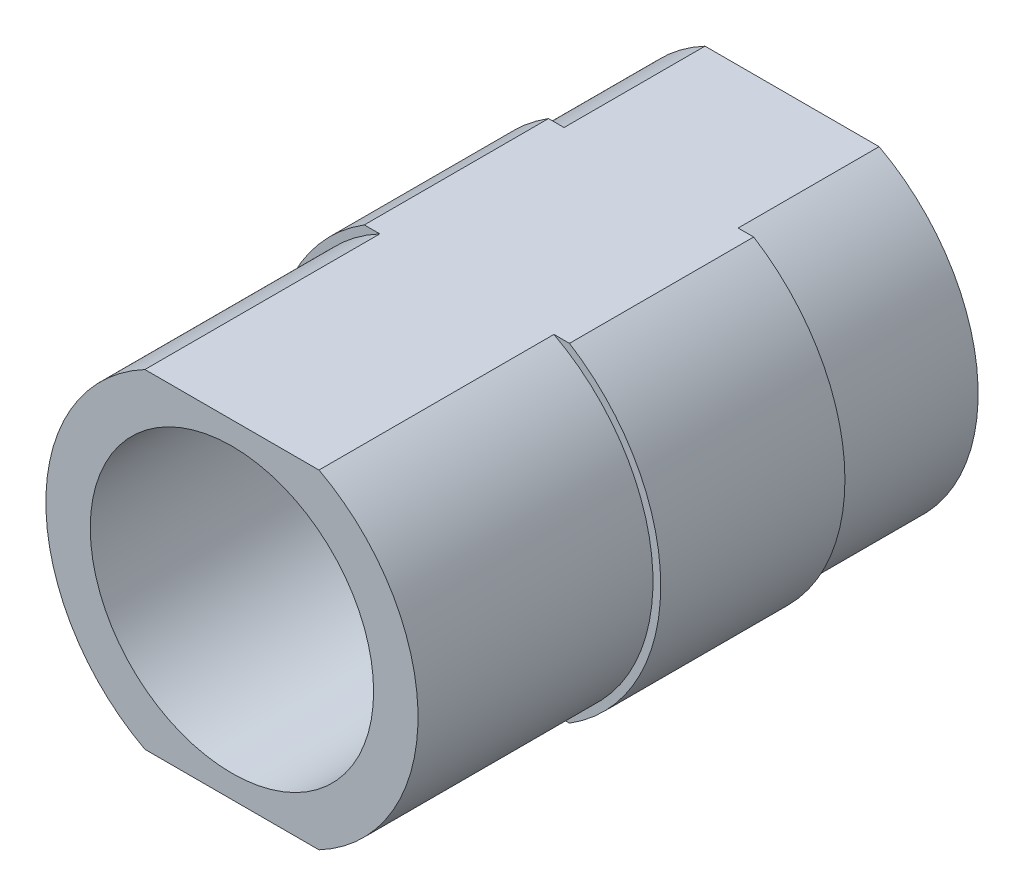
from build123d import *

# Parameters (mm, degrees)
ESQUISSE1_R             = 4.125
EXTRUSION1_DEPTH        = 11.92
ESQUISSE2_R             = 3.015
ENL_V_MAT_EXTRU_1_DEPTH = 14.270932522
ENL_V_START             = -5
ESQUISSE3_R             = 4.125
ESQUISSE3_R_2           = 3.96
ENL_V_MAT_EXTRU_3_DEPTH = 5
ESQUISSE4_R             = 4.125
ESQUISSE4_R_2           = 3.96
ENL_V_MAT_EXTRU_4_DEPTH = 3
ENL_V_MAT_EXTRU_5_DEPTH = 14.270932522


with BuildPart() as part:
    # Esquisse1 → Extrusion1 (new body)
    with BuildSketch(Plane.XY):
        Circle(ESQUISSE1_R)
    extrude(amount=EXTRUSION1_DEPTH)

    # Esquisse2 → Enl_v. mat.-Extru.1 (cut, through all)
    with BuildSketch(Plane.XY.offset(11.92)):
        Circle(ESQUISSE2_R)
    extrude(amount=-ENL_V_MAT_EXTRU_1_DEPTH, mode=Mode.SUBTRACT)

    # Esquisse3 → Enl_v. mat.-Extru.3 (cut)
    with BuildSketch(Plane.XY.offset(11.92).offset(ENL_V_START)):
        Circle(ESQUISSE3_R)
        Circle(ESQUISSE3_R_2, mode=Mode.SUBTRACT)
    extrude(amount=ENL_V_MAT_EXTRU_3_DEPTH, mode=Mode.SUBTRACT)

    # Esquisse4 → Enl_v. mat.-Extru.4 (cut)
    with BuildSketch(Plane(origin=(0, 0, 0), x_dir=(-1, 0, 0), z_dir=(0, 0, -1))):
        Circle(ESQUISSE4_R)
        with Locations(Location((0, 0, 0), (0, 0, 180))):
            Circle(ESQUISSE4_R_2, mode=Mode.SUBTRACT)
    extrude(amount=-ENL_V_MAT_EXTRU_4_DEPTH, mode=Mode.SUBTRACT)

    # Esquisse7 → Enl_v. mat.-Extru.5 (cut, through all)
    with BuildSketch(Plane.XY.offset(11.92)):
        with BuildLine():
            ThreePointArc((2.18303115, 3.5), (0, 4.125), (-2.18303115, 3.5))
            Line((-2.18303115, 3.5), (2.18303115, 3.5))
        make_face()
        with BuildLine():
            Line((2.18303115, -3.5), (-2.18303115, -3.5))
            ThreePointArc((-2.18303115, -3.5), (0, -4.125), (2.18303115, -3.5))
        make_face()
    extrude(amount=-ENL_V_MAT_EXTRU_5_DEPTH, mode=Mode.SUBTRACT)


solid = part.part
